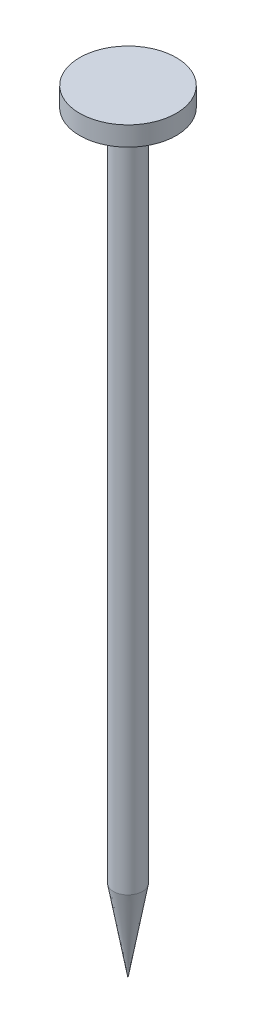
from build123d import *


with BuildPart() as part:
    # Skizze1 → Rotation1 (revolve)
    with BuildSketch(Plane.XY, mode=Mode.PRIVATE) as rotation1_sk:
        Polygon((0, 0), (0.75, 4.253461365), (0.75, 39), (2.5, 39), (2.5, 40), (0, 40), align=None)
    revolve(rotation1_sk.sketch.rotate(Axis((0, 0, 0), (0, -1, 0)), 90), axis=Axis((0, 0, 0), (0, -1, 0)))


solid = part.part
